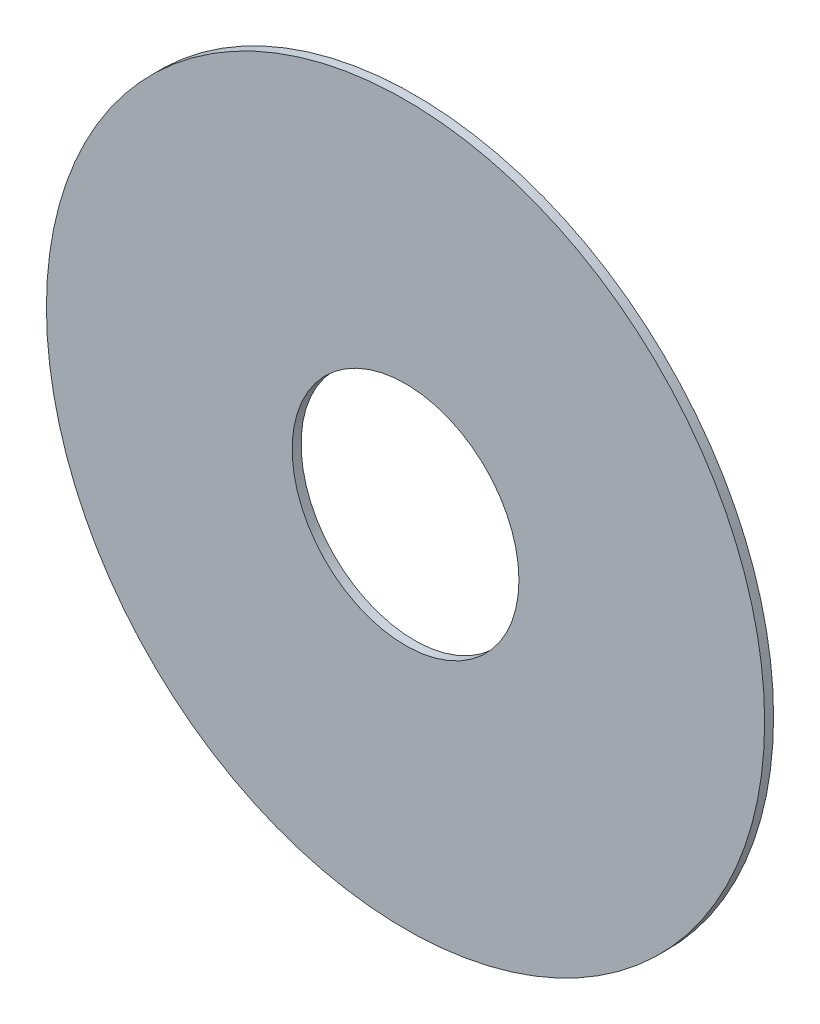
ISO-10303-21;
HEADER;
FILE_DESCRIPTION(('STEP AP214'),'2;1');
FILE_NAME('part.step','',(''),(''),'','','');
FILE_SCHEMA(('AUTOMOTIVE_DESIGN { 1 0 10303 214 1 1 1 1 }'));
ENDSEC;
DATA;
#1=APPLICATION_CONTEXT('core data for automotive mechanical design processes');
#2=APPLICATION_PROTOCOL_DEFINITION('international standard','automotive_design',2000,#1);
#3=PRODUCT_CONTEXT('',#1,'mechanical');
#4=PRODUCT('Part','Part','',(#3));
#5=PRODUCT_RELATED_PRODUCT_CATEGORY('part','',(#4));
#6=PRODUCT_DEFINITION_FORMATION('','',#4);
#7=PRODUCT_DEFINITION_CONTEXT('part definition',#1,'design');
#8=PRODUCT_DEFINITION('design','',#6,#7);
#9=PRODUCT_DEFINITION_SHAPE('','',#8);
#10=(LENGTH_UNIT() NAMED_UNIT(*) SI_UNIT(.MILLI.,.METRE.));
#11=(NAMED_UNIT(*) PLANE_ANGLE_UNIT() SI_UNIT($,.RADIAN.));
#12=(NAMED_UNIT(*) SI_UNIT($,.STERADIAN.) SOLID_ANGLE_UNIT());
#13=UNCERTAINTY_MEASURE_WITH_UNIT(LENGTH_MEASURE(1.E-05),#10,'distance_accuracy_value','');
#14=(GEOMETRIC_REPRESENTATION_CONTEXT(3) GLOBAL_UNCERTAINTY_ASSIGNED_CONTEXT((#13)) GLOBAL_UNIT_ASSIGNED_CONTEXT((#10,
#11,#12)) REPRESENTATION_CONTEXT('',''));
#15=CARTESIAN_POINT('',(0.,0.,0.));
#16=DIRECTION('',(0.,0.,1.));
#17=DIRECTION('',(1.,0.,0.));
#18=AXIS2_PLACEMENT_3D('',#15,#16,#17);
#19=CARTESIAN_POINT('',(0.,0.,0.3));
#20=DIRECTION('',(0.,0.,1.));
#21=DIRECTION('',(1.,0.,0.));
#22=AXIS2_PLACEMENT_3D('',#19,#20,#21);
#23=PLANE('',#22);
#24=CARTESIAN_POINT('',(0.,0.,0.3));
#25=DIRECTION('',(0.,0.,1.));
#26=DIRECTION('',(1.,0.,0.));
#27=AXIS2_PLACEMENT_3D('',#24,#25,#26);
#28=CIRCLE('',#27,12.065);
#29=CARTESIAN_POINT('',(12.065,0.,0.3));
#30=VERTEX_POINT('',#29);
#31=EDGE_CURVE('E10',#30,#30,#28,.T.);
#32=ORIENTED_EDGE('',*,*,#31,.T.);
#33=EDGE_LOOP('',(#32));
#34=FACE_BOUND('',#33,.T.);
#35=CARTESIAN_POINT('',(0.,0.,0.3));
#36=DIRECTION('',(0.,0.,1.));
#37=DIRECTION('',(1.,0.,0.));
#38=AXIS2_PLACEMENT_3D('',#35,#36,#37);
#39=CIRCLE('',#38,3.81);
#40=CARTESIAN_POINT('',(3.81,0.,0.3));
#41=VERTEX_POINT('',#40);
#42=EDGE_CURVE('E42',#41,#41,#39,.T.);
#43=ORIENTED_EDGE('',*,*,#42,.F.);
#44=EDGE_LOOP('',(#43));
#45=FACE_BOUND('',#44,.T.);
#46=ADVANCED_FACE('F31',(#34,#45),#23,.T.);
#47=CARTESIAN_POINT('',(0.,0.,0.));
#48=DIRECTION('',(0.,0.,1.));
#49=DIRECTION('',(1.,0.,0.));
#50=AXIS2_PLACEMENT_3D('',#47,#48,#49);
#51=PLANE('',#50);
#52=CARTESIAN_POINT('',(0.,0.,0.));
#53=DIRECTION('',(0.,0.,1.));
#54=DIRECTION('',(1.,0.,0.));
#55=AXIS2_PLACEMENT_3D('',#52,#53,#54);
#56=CIRCLE('',#55,12.065);
#57=CARTESIAN_POINT('',(12.065,0.,0.));
#58=VERTEX_POINT('',#57);
#59=EDGE_CURVE('E35',#58,#58,#56,.T.);
#60=ORIENTED_EDGE('',*,*,#59,.F.);
#61=EDGE_LOOP('',(#60));
#62=FACE_BOUND('',#61,.T.);
#63=CARTESIAN_POINT('',(0.,0.,0.));
#64=DIRECTION('',(0.,0.,1.));
#65=DIRECTION('',(1.,0.,0.));
#66=AXIS2_PLACEMENT_3D('',#63,#64,#65);
#67=CIRCLE('',#66,3.81);
#68=CARTESIAN_POINT('',(3.81,0.,0.));
#69=VERTEX_POINT('',#68);
#70=EDGE_CURVE('E44',#69,#69,#67,.T.);
#71=ORIENTED_EDGE('',*,*,#70,.T.);
#72=EDGE_LOOP('',(#71));
#73=FACE_BOUND('',#72,.T.);
#74=ADVANCED_FACE('F54',(#62,#73),#51,.F.);
#75=CARTESIAN_POINT('',(0.,0.,0.3));
#76=DIRECTION('',(0.,0.,-1.));
#77=DIRECTION('',(-1.,0.,0.));
#78=AXIS2_PLACEMENT_3D('',#75,#76,#77);
#79=CYLINDRICAL_SURFACE('',#78,12.065);
#80=ORIENTED_EDGE('',*,*,#31,.F.);
#81=EDGE_LOOP('',(#80));
#82=FACE_BOUND('',#81,.T.);
#83=ORIENTED_EDGE('',*,*,#59,.T.);
#84=EDGE_LOOP('',(#83));
#85=FACE_BOUND('',#84,.T.);
#86=ADVANCED_FACE('F33',(#82,#85),#79,.T.);
#87=CARTESIAN_POINT('',(0.,0.,0.3));
#88=DIRECTION('',(0.,0.,-1.));
#89=DIRECTION('',(-1.,0.,0.));
#90=AXIS2_PLACEMENT_3D('',#87,#88,#89);
#91=CYLINDRICAL_SURFACE('',#90,3.81);
#92=ORIENTED_EDGE('',*,*,#42,.T.);
#93=EDGE_LOOP('',(#92));
#94=FACE_BOUND('',#93,.T.);
#95=ORIENTED_EDGE('',*,*,#70,.F.);
#96=EDGE_LOOP('',(#95));
#97=FACE_BOUND('',#96,.T.);
#98=ADVANCED_FACE('F50',(#94,#97),#91,.F.);
#99=CLOSED_SHELL('',(#46,#74,#86,#98));
#100=MANIFOLD_SOLID_BREP('B2',#99);
#101=ADVANCED_BREP_SHAPE_REPRESENTATION('',(#18,#100),#14);
#102=SHAPE_DEFINITION_REPRESENTATION(#9,#101);
ENDSEC;
END-ISO-10303-21;
